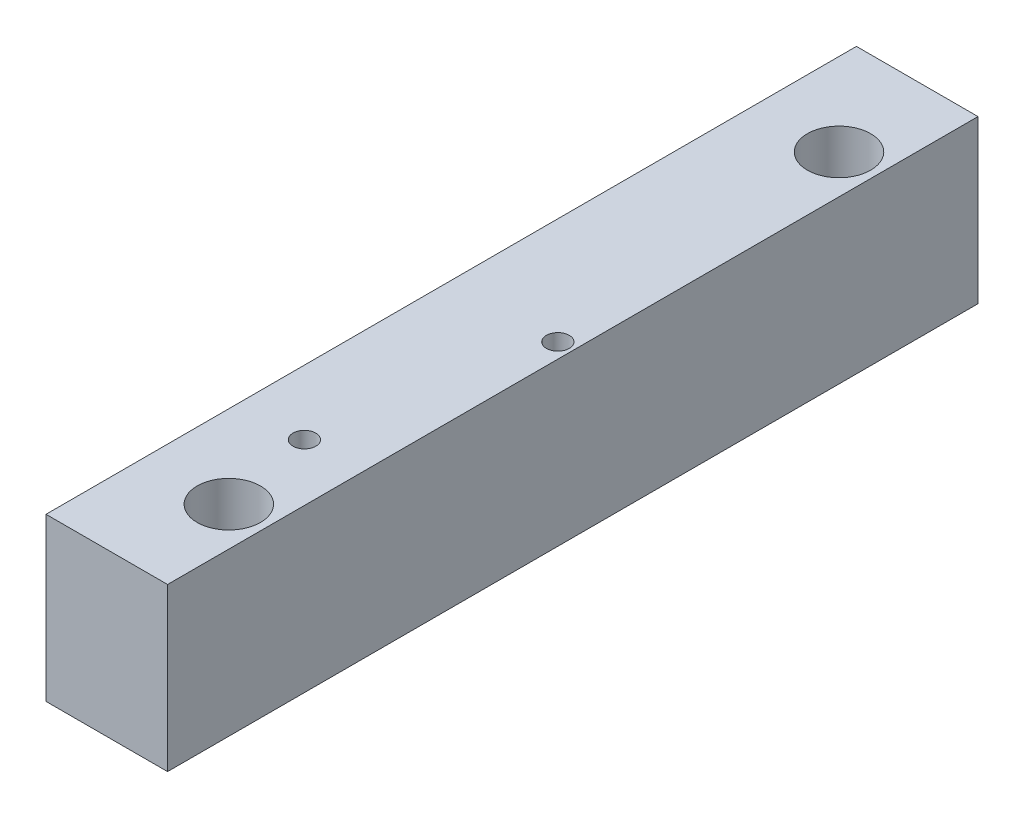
ISO-10303-21;
HEADER;
FILE_DESCRIPTION(('STEP AP214'),'2;1');
FILE_NAME('part.step','',(''),(''),'','','');
FILE_SCHEMA(('AUTOMOTIVE_DESIGN { 1 0 10303 214 1 1 1 1 }'));
ENDSEC;
DATA;
#1=APPLICATION_CONTEXT('core data for automotive mechanical design processes');
#2=APPLICATION_PROTOCOL_DEFINITION('international standard','automotive_design',2000,#1);
#3=PRODUCT_CONTEXT('',#1,'mechanical');
#4=PRODUCT('Part','Part','',(#3));
#5=PRODUCT_RELATED_PRODUCT_CATEGORY('part','',(#4));
#6=PRODUCT_DEFINITION_FORMATION('','',#4);
#7=PRODUCT_DEFINITION_CONTEXT('part definition',#1,'design');
#8=PRODUCT_DEFINITION('design','',#6,#7);
#9=PRODUCT_DEFINITION_SHAPE('','',#8);
#10=(LENGTH_UNIT() NAMED_UNIT(*) SI_UNIT(.MILLI.,.METRE.));
#11=(NAMED_UNIT(*) PLANE_ANGLE_UNIT() SI_UNIT($,.RADIAN.));
#12=(NAMED_UNIT(*) SI_UNIT($,.STERADIAN.) SOLID_ANGLE_UNIT());
#13=UNCERTAINTY_MEASURE_WITH_UNIT(LENGTH_MEASURE(1.E-05),#10,'distance_accuracy_value','');
#14=(GEOMETRIC_REPRESENTATION_CONTEXT(3) GLOBAL_UNCERTAINTY_ASSIGNED_CONTEXT((#13)) GLOBAL_UNIT_ASSIGNED_CONTEXT((#10,
#11,#12)) REPRESENTATION_CONTEXT('',''));
#15=CARTESIAN_POINT('',(0.,0.,0.));
#16=DIRECTION('',(0.,0.,1.));
#17=DIRECTION('',(1.,0.,0.));
#18=AXIS2_PLACEMENT_3D('',#15,#16,#17);
#19=CARTESIAN_POINT('',(-19.05,25.4,127.));
#20=DIRECTION('',(0.,-1.,0.));
#21=DIRECTION('',(0.,0.,-1.));
#22=AXIS2_PLACEMENT_3D('',#19,#20,#21);
#23=PLANE('',#22);
#24=DIRECTION('',(-1.,0.,0.));
#25=VECTOR('',#24,1.);
#26=CARTESIAN_POINT('',(-19.05,25.4,-127.));
#27=LINE('',#26,#25);
#28=CARTESIAN_POINT('',(19.05,25.4,-127.));
#29=VERTEX_POINT('',#28);
#30=CARTESIAN_POINT('',(-19.05,25.4,-127.));
#31=VERTEX_POINT('',#30);
#32=EDGE_CURVE('E91',#29,#31,#27,.T.);
#33=ORIENTED_EDGE('',*,*,#32,.T.);
#34=DIRECTION('',(0.,0.,-1.));
#35=VECTOR('',#34,1.);
#36=CARTESIAN_POINT('',(-19.05,25.4,127.));
#37=LINE('',#36,#35);
#38=CARTESIAN_POINT('',(-19.05,25.4,127.));
#39=VERTEX_POINT('',#38);
#40=EDGE_CURVE('E44',#39,#31,#37,.T.);
#41=ORIENTED_EDGE('',*,*,#40,.F.);
#42=DIRECTION('',(-1.,0.,0.));
#43=VECTOR('',#42,1.);
#44=CARTESIAN_POINT('',(-19.05,25.4,127.));
#45=LINE('',#44,#43);
#46=CARTESIAN_POINT('',(19.05,25.4,127.));
#47=VERTEX_POINT('',#46);
#48=EDGE_CURVE('E82',#47,#39,#45,.T.);
#49=ORIENTED_EDGE('',*,*,#48,.F.);
#50=DIRECTION('',(0.,0.,-1.));
#51=VECTOR('',#50,1.);
#52=CARTESIAN_POINT('',(19.05,25.4,127.));
#53=LINE('',#52,#51);
#54=EDGE_CURVE('E11',#47,#29,#53,.T.);
#55=ORIENTED_EDGE('',*,*,#54,.T.);
#56=EDGE_LOOP('',(#33,#41,#49,#55));
#57=FACE_BOUND('',#56,.T.);
#58=CARTESIAN_POINT('',(6.86860466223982,25.4,95.6199459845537));
#59=DIRECTION('',(0.,1.,0.));
#60=DIRECTION('',(0.,0.,1.));
#61=AXIS2_PLACEMENT_3D('',#58,#59,#60);
#62=CIRCLE('',#61,9.92187499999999);
#63=CARTESIAN_POINT('',(6.86860466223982,25.4,105.541820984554));
#64=VERTEX_POINT('',#63);
#65=EDGE_CURVE('E115',#64,#64,#62,.T.);
#66=ORIENTED_EDGE('',*,*,#65,.F.);
#67=EDGE_LOOP('',(#66));
#68=FACE_BOUND('',#67,.T.);
#69=CARTESIAN_POINT('',(6.8686046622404,25.4,-95.6199459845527));
#70=DIRECTION('',(0.,1.,0.));
#71=DIRECTION('',(0.,0.,1.));
#72=AXIS2_PLACEMENT_3D('',#69,#70,#71);
#73=CIRCLE('',#72,9.92187499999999);
#74=CARTESIAN_POINT('',(6.8686046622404,25.4,-85.6980709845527));
#75=VERTEX_POINT('',#74);
#76=EDGE_CURVE('E121',#75,#75,#73,.T.);
#77=ORIENTED_EDGE('',*,*,#76,.F.);
#78=EDGE_LOOP('',(#77));
#79=FACE_BOUND('',#78,.T.);
#80=CARTESIAN_POINT('',(14.3637,25.4,3.60822483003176E-12));
#81=DIRECTION('',(0.,1.,0.));
#82=DIRECTION('',(0.,0.,1.));
#83=AXIS2_PLACEMENT_3D('',#80,#81,#82);
#84=CIRCLE('',#83,3.571875);
#85=CARTESIAN_POINT('',(14.3637,25.4,3.5718750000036));
#86=VERTEX_POINT('',#85);
#87=EDGE_CURVE('E127',#86,#86,#84,.T.);
#88=ORIENTED_EDGE('',*,*,#87,.F.);
#89=EDGE_LOOP('',(#88));
#90=FACE_BOUND('',#89,.T.);
#91=CARTESIAN_POINT('',(1.18620422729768,25.4,66.247744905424));
#92=DIRECTION('',(0.,1.,0.));
#93=DIRECTION('',(0.,0.,1.));
#94=AXIS2_PLACEMENT_3D('',#91,#92,#93);
#95=CIRCLE('',#94,3.571875);
#96=CARTESIAN_POINT('',(1.18620422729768,25.4,69.819619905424));
#97=VERTEX_POINT('',#96);
#98=EDGE_CURVE('E133',#97,#97,#95,.T.);
#99=ORIENTED_EDGE('',*,*,#98,.F.);
#100=EDGE_LOOP('',(#99));
#101=FACE_BOUND('',#100,.T.);
#102=ADVANCED_FACE('F35',(#57,#68,#79,#90,#101),#23,.F.);
#103=CARTESIAN_POINT('',(19.05,-25.4,127.));
#104=DIRECTION('',(-1.,0.,0.));
#105=DIRECTION('',(0.,0.,1.));
#106=AXIS2_PLACEMENT_3D('',#103,#104,#105);
#107=PLANE('',#106);
#108=DIRECTION('',(0.,1.,0.));
#109=VECTOR('',#108,1.);
#110=CARTESIAN_POINT('',(19.05,-25.4,-127.));
#111=LINE('',#110,#109);
#112=CARTESIAN_POINT('',(19.05,-25.4,-127.));
#113=VERTEX_POINT('',#112);
#114=EDGE_CURVE('E99',#113,#29,#111,.T.);
#115=ORIENTED_EDGE('',*,*,#114,.T.);
#116=ORIENTED_EDGE('',*,*,#54,.F.);
#117=DIRECTION('',(0.,1.,0.));
#118=VECTOR('',#117,1.);
#119=CARTESIAN_POINT('',(19.05,-25.4,127.));
#120=LINE('',#119,#118);
#121=CARTESIAN_POINT('',(19.05,-25.4,127.));
#122=VERTEX_POINT('',#121);
#123=EDGE_CURVE('E87',#122,#47,#120,.T.);
#124=ORIENTED_EDGE('',*,*,#123,.F.);
#125=DIRECTION('',(0.,0.,-1.));
#126=VECTOR('',#125,1.);
#127=CARTESIAN_POINT('',(19.05,-25.4,127.));
#128=LINE('',#127,#126);
#129=EDGE_CURVE('E95',#122,#113,#128,.T.);
#130=ORIENTED_EDGE('',*,*,#129,.T.);
#131=EDGE_LOOP('',(#115,#116,#124,#130));
#132=FACE_BOUND('',#131,.T.);
#133=ADVANCED_FACE('F37',(#132),#107,.F.);
#134=CARTESIAN_POINT('',(-19.05,-25.4,127.));
#135=DIRECTION('',(1.,0.,0.));
#136=DIRECTION('',(0.,0.,-1.));
#137=AXIS2_PLACEMENT_3D('',#134,#135,#136);
#138=PLANE('',#137);
#139=DIRECTION('',(0.,-1.,0.));
#140=VECTOR('',#139,1.);
#141=CARTESIAN_POINT('',(-19.05,-25.4,-127.));
#142=LINE('',#141,#140);
#143=CARTESIAN_POINT('',(-19.05,-25.4,-127.));
#144=VERTEX_POINT('',#143);
#145=EDGE_CURVE('E69',#31,#144,#142,.T.);
#146=ORIENTED_EDGE('',*,*,#145,.T.);
#147=DIRECTION('',(0.,0.,-1.));
#148=VECTOR('',#147,1.);
#149=CARTESIAN_POINT('',(-19.05,-25.4,127.));
#150=LINE('',#149,#148);
#151=CARTESIAN_POINT('',(-19.05,-25.4,127.));
#152=VERTEX_POINT('',#151);
#153=EDGE_CURVE('E92',#152,#144,#150,.T.);
#154=ORIENTED_EDGE('',*,*,#153,.F.);
#155=DIRECTION('',(0.,-1.,0.));
#156=VECTOR('',#155,1.);
#157=CARTESIAN_POINT('',(-19.05,-25.4,127.));
#158=LINE('',#157,#156);
#159=EDGE_CURVE('E85',#39,#152,#158,.T.);
#160=ORIENTED_EDGE('',*,*,#159,.F.);
#161=ORIENTED_EDGE('',*,*,#40,.T.);
#162=EDGE_LOOP('',(#146,#154,#160,#161));
#163=FACE_BOUND('',#162,.T.);
#164=ADVANCED_FACE('F93',(#163),#138,.F.);
#165=CARTESIAN_POINT('',(-19.05,-25.4,127.));
#166=DIRECTION('',(0.,1.,0.));
#167=DIRECTION('',(0.,0.,1.));
#168=AXIS2_PLACEMENT_3D('',#165,#166,#167);
#169=PLANE('',#168);
#170=CARTESIAN_POINT('',(1.18620422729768,-25.4,66.247744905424));
#171=DIRECTION('',(0.,1.,0.));
#172=DIRECTION('',(0.,0.,1.));
#173=AXIS2_PLACEMENT_3D('',#170,#171,#172);
#174=CIRCLE('',#173,3.57187499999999);
#175=CARTESIAN_POINT('',(1.18620422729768,-25.4,69.819619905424));
#176=VERTEX_POINT('',#175);
#177=EDGE_CURVE('E130',#176,#176,#174,.T.);
#178=ORIENTED_EDGE('',*,*,#177,.T.);
#179=EDGE_LOOP('',(#178));
#180=FACE_BOUND('',#179,.T.);
#181=CARTESIAN_POINT('',(14.3637,-25.4,3.60822483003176E-12));
#182=DIRECTION('',(0.,1.,0.));
#183=DIRECTION('',(0.,0.,1.));
#184=AXIS2_PLACEMENT_3D('',#181,#182,#183);
#185=CIRCLE('',#184,3.57187499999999);
#186=CARTESIAN_POINT('',(14.3637,-25.4,3.5718750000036));
#187=VERTEX_POINT('',#186);
#188=EDGE_CURVE('E124',#187,#187,#185,.T.);
#189=ORIENTED_EDGE('',*,*,#188,.T.);
#190=EDGE_LOOP('',(#189));
#191=FACE_BOUND('',#190,.T.);
#192=CARTESIAN_POINT('',(6.8686046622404,-25.4,-95.6199459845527));
#193=DIRECTION('',(0.,1.,0.));
#194=DIRECTION('',(0.,0.,1.));
#195=AXIS2_PLACEMENT_3D('',#192,#193,#194);
#196=CIRCLE('',#195,9.92187499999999);
#197=CARTESIAN_POINT('',(6.8686046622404,-25.4,-85.6980709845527));
#198=VERTEX_POINT('',#197);
#199=EDGE_CURVE('E118',#198,#198,#196,.T.);
#200=ORIENTED_EDGE('',*,*,#199,.T.);
#201=EDGE_LOOP('',(#200));
#202=FACE_BOUND('',#201,.T.);
#203=CARTESIAN_POINT('',(6.86860466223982,-25.4,95.6199459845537));
#204=DIRECTION('',(0.,1.,0.));
#205=DIRECTION('',(0.,0.,1.));
#206=AXIS2_PLACEMENT_3D('',#203,#204,#205);
#207=CIRCLE('',#206,9.92187499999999);
#208=CARTESIAN_POINT('',(6.86860466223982,-25.4,105.541820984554));
#209=VERTEX_POINT('',#208);
#210=EDGE_CURVE('E102',#209,#209,#207,.T.);
#211=ORIENTED_EDGE('',*,*,#210,.T.);
#212=EDGE_LOOP('',(#211));
#213=FACE_BOUND('',#212,.T.);
#214=DIRECTION('',(1.,0.,0.));
#215=VECTOR('',#214,1.);
#216=CARTESIAN_POINT('',(-19.05,-25.4,-127.));
#217=LINE('',#216,#215);
#218=EDGE_CURVE('E75',#144,#113,#217,.T.);
#219=ORIENTED_EDGE('',*,*,#218,.T.);
#220=ORIENTED_EDGE('',*,*,#129,.F.);
#221=DIRECTION('',(1.,0.,0.));
#222=VECTOR('',#221,1.);
#223=CARTESIAN_POINT('',(-19.05,-25.4,127.));
#224=LINE('',#223,#222);
#225=EDGE_CURVE('E52',#152,#122,#224,.T.);
#226=ORIENTED_EDGE('',*,*,#225,.F.);
#227=ORIENTED_EDGE('',*,*,#153,.T.);
#228=EDGE_LOOP('',(#219,#220,#226,#227));
#229=FACE_BOUND('',#228,.T.);
#230=ADVANCED_FACE('F107',(#180,#191,#202,#213,#229),#169,.F.);
#231=CARTESIAN_POINT('',(0.,0.,127.));
#232=DIRECTION('',(0.,0.,-1.));
#233=DIRECTION('',(-1.,0.,0.));
#234=AXIS2_PLACEMENT_3D('',#231,#232,#233);
#235=PLANE('',#234);
#236=ORIENTED_EDGE('',*,*,#123,.T.);
#237=ORIENTED_EDGE('',*,*,#48,.T.);
#238=ORIENTED_EDGE('',*,*,#159,.T.);
#239=ORIENTED_EDGE('',*,*,#225,.T.);
#240=EDGE_LOOP('',(#236,#237,#238,#239));
#241=FACE_BOUND('',#240,.T.);
#242=ADVANCED_FACE('F83',(#241),#235,.F.);
#243=CARTESIAN_POINT('',(0.,0.,-127.));
#244=DIRECTION('',(0.,0.,-1.));
#245=DIRECTION('',(-1.,0.,0.));
#246=AXIS2_PLACEMENT_3D('',#243,#244,#245);
#247=PLANE('',#246);
#248=ORIENTED_EDGE('',*,*,#114,.F.);
#249=ORIENTED_EDGE('',*,*,#218,.F.);
#250=ORIENTED_EDGE('',*,*,#145,.F.);
#251=ORIENTED_EDGE('',*,*,#32,.F.);
#252=EDGE_LOOP('',(#248,#249,#250,#251));
#253=FACE_BOUND('',#252,.T.);
#254=ADVANCED_FACE('F110',(#253),#247,.T.);
#255=CARTESIAN_POINT('',(6.86860466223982,25.4,95.6199459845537));
#256=DIRECTION('',(0.,1.,0.));
#257=DIRECTION('',(0.,0.,1.));
#258=AXIS2_PLACEMENT_3D('',#255,#256,#257);
#259=CYLINDRICAL_SURFACE('',#258,9.92187499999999);
#260=ORIENTED_EDGE('',*,*,#210,.F.);
#261=EDGE_LOOP('',(#260));
#262=FACE_BOUND('',#261,.T.);
#263=ORIENTED_EDGE('',*,*,#65,.T.);
#264=EDGE_LOOP('',(#263));
#265=FACE_BOUND('',#264,.T.);
#266=ADVANCED_FACE('F151',(#262,#265),#259,.F.);
#267=CARTESIAN_POINT('',(6.8686046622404,25.4,-95.6199459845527));
#268=DIRECTION('',(0.,1.,0.));
#269=DIRECTION('',(0.,0.,1.));
#270=AXIS2_PLACEMENT_3D('',#267,#268,#269);
#271=CYLINDRICAL_SURFACE('',#270,9.92187499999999);
#272=ORIENTED_EDGE('',*,*,#199,.F.);
#273=EDGE_LOOP('',(#272));
#274=FACE_BOUND('',#273,.T.);
#275=ORIENTED_EDGE('',*,*,#76,.T.);
#276=EDGE_LOOP('',(#275));
#277=FACE_BOUND('',#276,.T.);
#278=ADVANCED_FACE('F156',(#274,#277),#271,.F.);
#279=CARTESIAN_POINT('',(14.3637,25.4,3.60822483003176E-12));
#280=DIRECTION('',(0.,1.,0.));
#281=DIRECTION('',(0.,0.,1.));
#282=AXIS2_PLACEMENT_3D('',#279,#280,#281);
#283=CYLINDRICAL_SURFACE('',#282,3.57187499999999);
#284=ORIENTED_EDGE('',*,*,#188,.F.);
#285=EDGE_LOOP('',(#284));
#286=FACE_BOUND('',#285,.T.);
#287=ORIENTED_EDGE('',*,*,#87,.T.);
#288=EDGE_LOOP('',(#287));
#289=FACE_BOUND('',#288,.T.);
#290=ADVANCED_FACE('F160',(#286,#289),#283,.F.);
#291=CARTESIAN_POINT('',(1.18620422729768,25.4,66.247744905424));
#292=DIRECTION('',(0.,1.,0.));
#293=DIRECTION('',(0.,0.,1.));
#294=AXIS2_PLACEMENT_3D('',#291,#292,#293);
#295=CYLINDRICAL_SURFACE('',#294,3.57187499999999);
#296=ORIENTED_EDGE('',*,*,#177,.F.);
#297=EDGE_LOOP('',(#296));
#298=FACE_BOUND('',#297,.T.);
#299=ORIENTED_EDGE('',*,*,#98,.T.);
#300=EDGE_LOOP('',(#299));
#301=FACE_BOUND('',#300,.T.);
#302=ADVANCED_FACE('F137',(#298,#301),#295,.F.);
#303=CLOSED_SHELL('',(#102,#133,#164,#230,#242,#254,#266,#278,#290,#302));
#304=MANIFOLD_SOLID_BREP('B2',#303);
#305=ADVANCED_BREP_SHAPE_REPRESENTATION('',(#18,#304),#14);
#306=SHAPE_DEFINITION_REPRESENTATION(#9,#305);
ENDSEC;
END-ISO-10303-21;
